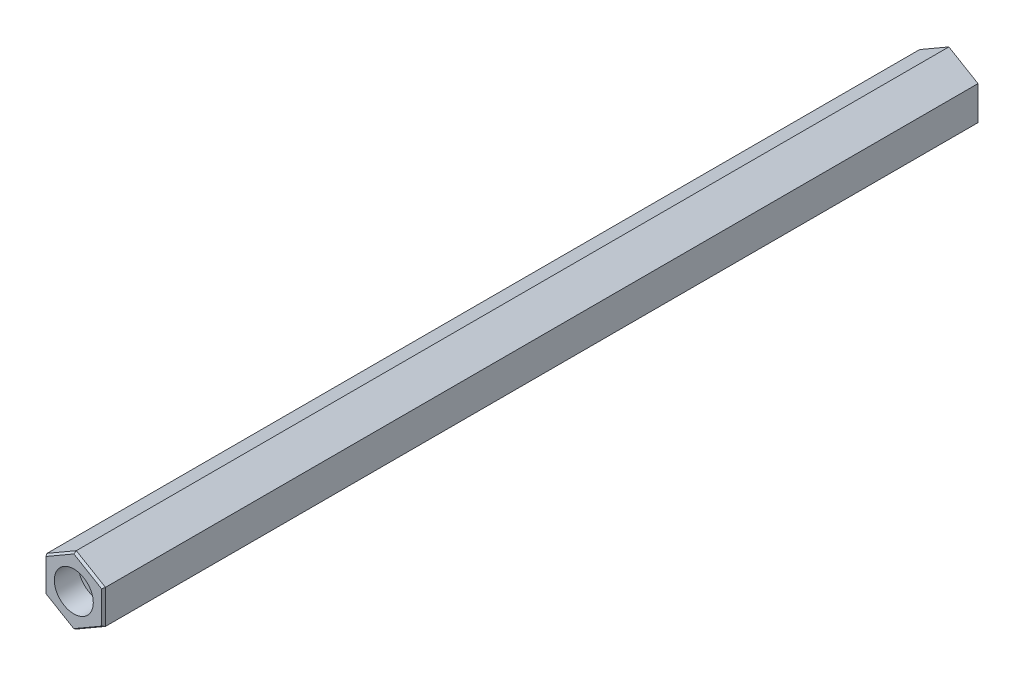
ISO-10303-21;
HEADER;
FILE_DESCRIPTION(('STEP AP214'),'2;1');
FILE_NAME('part.step','',(''),(''),'','','');
FILE_SCHEMA(('AUTOMOTIVE_DESIGN { 1 0 10303 214 1 1 1 1 }'));
ENDSEC;
DATA;
#1=APPLICATION_CONTEXT('core data for automotive mechanical design processes');
#2=APPLICATION_PROTOCOL_DEFINITION('international standard','automotive_design',2000,#1);
#3=PRODUCT_CONTEXT('',#1,'mechanical');
#4=PRODUCT('Part','Part','',(#3));
#5=PRODUCT_RELATED_PRODUCT_CATEGORY('part','',(#4));
#6=PRODUCT_DEFINITION_FORMATION('','',#4);
#7=PRODUCT_DEFINITION_CONTEXT('part definition',#1,'design');
#8=PRODUCT_DEFINITION('design','',#6,#7);
#9=PRODUCT_DEFINITION_SHAPE('','',#8);
#10=(LENGTH_UNIT() NAMED_UNIT(*) SI_UNIT(.MILLI.,.METRE.));
#11=(NAMED_UNIT(*) PLANE_ANGLE_UNIT() SI_UNIT($,.RADIAN.));
#12=(NAMED_UNIT(*) SI_UNIT($,.STERADIAN.) SOLID_ANGLE_UNIT());
#13=UNCERTAINTY_MEASURE_WITH_UNIT(LENGTH_MEASURE(1.E-05),#10,'distance_accuracy_value','');
#14=(GEOMETRIC_REPRESENTATION_CONTEXT(3) GLOBAL_UNCERTAINTY_ASSIGNED_CONTEXT((#13)) GLOBAL_UNIT_ASSIGNED_CONTEXT((#10,
#11,#12)) REPRESENTATION_CONTEXT('',''));
#15=CARTESIAN_POINT('',(0.,0.,0.));
#16=DIRECTION('',(0.,0.,1.));
#17=DIRECTION('',(1.,0.,0.));
#18=AXIS2_PLACEMENT_3D('',#15,#16,#17);
#19=CARTESIAN_POINT('',(-12.0000000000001,7.0471016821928,-180.));
#20=DIRECTION('',(-1.,0.,0.));
#21=DIRECTION('',(0.,-1.,0.));
#22=AXIS2_PLACEMENT_3D('',#19,#20,#21);
#23=PLANE('',#22);
#24=DIRECTION('',(0.,0.,1.));
#25=VECTOR('',#24,1.);
#26=CARTESIAN_POINT('',(-12.0000000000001,7.0471016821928,-180.));
#27=LINE('',#26,#25);
#28=CARTESIAN_POINT('',(-12.0000000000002,7.04710168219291,-179.422649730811));
#29=VERTEX_POINT('',#28);
#30=CARTESIAN_POINT('',(-12.,7.04710168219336,179.));
#31=VERTEX_POINT('',#30);
#32=EDGE_CURVE('E118',#29,#31,#27,.T.);
#33=ORIENTED_EDGE('',*,*,#32,.F.);
#34=DIRECTION('',(0.,-1.,0.));
#35=VECTOR('',#34,1.);
#36=CARTESIAN_POINT('',(-12.0000000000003,-6.85289831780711,-179.422649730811));
#37=LINE('',#36,#35);
#38=CARTESIAN_POINT('',(-12.0000000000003,-6.85289831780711,-179.422649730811));
#39=VERTEX_POINT('',#38);
#40=EDGE_CURVE('E113',#29,#39,#37,.T.);
#41=ORIENTED_EDGE('',*,*,#40,.T.);
#42=DIRECTION('',(0.,0.,1.));
#43=VECTOR('',#42,1.);
#44=CARTESIAN_POINT('',(-12.,-6.85289831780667,-180.));
#45=LINE('',#44,#43);
#46=CARTESIAN_POINT('',(-12.0000000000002,-6.85289831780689,179.));
#47=VERTEX_POINT('',#46);
#48=EDGE_CURVE('E115',#39,#47,#45,.T.);
#49=ORIENTED_EDGE('',*,*,#48,.T.);
#50=DIRECTION('',(0.,1.,0.));
#51=VECTOR('',#50,1.);
#52=CARTESIAN_POINT('',(-12.0000000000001,7.04710168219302,179.));
#53=LINE('',#52,#51);
#54=EDGE_CURVE('E124',#47,#31,#53,.T.);
#55=ORIENTED_EDGE('',*,*,#54,.T.);
#56=EDGE_LOOP('',(#33,#41,#49,#55));
#57=FACE_BOUND('',#56,.T.);
#58=ADVANCED_FACE('F26',(#57),#23,.T.);
#59=CARTESIAN_POINT('',(-12.0000000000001,7.0471016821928,-180.));
#60=DIRECTION('',(-0.501166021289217,0.865351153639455,0.));
#61=DIRECTION('',(-0.865351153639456,-0.501166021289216,0.));
#62=AXIS2_PLACEMENT_3D('',#59,#60,#61);
#63=PLANE('',#62);
#64=DIRECTION('',(0.,0.,1.));
#65=VECTOR('',#64,1.);
#66=CARTESIAN_POINT('',(0.0283810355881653,14.0133093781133,-180.));
#67=LINE('',#66,#65);
#68=CARTESIAN_POINT('',(0.0283810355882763,14.013309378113,-179.42264973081));
#69=VERTEX_POINT('',#68);
#70=CARTESIAN_POINT('',(0.0283810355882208,14.0133093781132,179.));
#71=VERTEX_POINT('',#70);
#72=EDGE_CURVE('E241',#69,#71,#67,.T.);
#73=ORIENTED_EDGE('',*,*,#72,.F.);
#74=DIRECTION('',(-0.865351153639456,-0.501166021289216,0.));
#75=VECTOR('',#74,1.);
#76=CARTESIAN_POINT('',(-12.0000000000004,7.04710168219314,-179.422649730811));
#77=LINE('',#76,#75);
#78=EDGE_CURVE('E180',#69,#29,#77,.T.);
#79=ORIENTED_EDGE('',*,*,#78,.T.);
#80=ORIENTED_EDGE('',*,*,#32,.T.);
#81=DIRECTION('',(0.865351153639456,0.501166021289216,0.));
#82=VECTOR('',#81,1.);
#83=CARTESIAN_POINT('',(-12.,7.04710168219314,179.));
#84=LINE('',#83,#82);
#85=EDGE_CURVE('E177',#31,#71,#84,.T.);
#86=ORIENTED_EDGE('',*,*,#85,.T.);
#87=EDGE_LOOP('',(#73,#79,#80,#86));
#88=FACE_BOUND('',#87,.T.);
#89=ADVANCED_FACE('F278',(#88),#63,.T.);
#90=CARTESIAN_POINT('',(0.0283810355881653,14.0133093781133,-180.));
#91=DIRECTION('',(0.508151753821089,0.861267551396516,0.));
#92=DIRECTION('',(-0.861267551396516,0.508151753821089,0.));
#93=AXIS2_PLACEMENT_3D('',#90,#91,#92);
#94=PLANE('',#93);
#95=DIRECTION('',(0.,0.,1.));
#96=VECTOR('',#95,1.);
#97=CARTESIAN_POINT('',(11.9999999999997,6.95000000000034,-180.));
#98=LINE('',#97,#96);
#99=CARTESIAN_POINT('',(11.9999999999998,6.95000000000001,-179.42264973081));
#100=VERTEX_POINT('',#99);
#101=CARTESIAN_POINT('',(12.,6.95000000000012,179.));
#102=VERTEX_POINT('',#101);
#103=EDGE_CURVE('E244',#100,#102,#98,.T.);
#104=ORIENTED_EDGE('',*,*,#103,.F.);
#105=DIRECTION('',(-0.861267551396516,0.508151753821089,0.));
#106=VECTOR('',#105,1.);
#107=CARTESIAN_POINT('',(0.0283810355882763,14.013309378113,-179.42264973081));
#108=LINE('',#107,#106);
#109=EDGE_CURVE('E175',#100,#69,#108,.T.);
#110=ORIENTED_EDGE('',*,*,#109,.T.);
#111=ORIENTED_EDGE('',*,*,#72,.T.);
#112=DIRECTION('',(0.861267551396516,-0.508151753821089,0.));
#113=VECTOR('',#112,1.);
#114=CARTESIAN_POINT('',(0.0283810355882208,14.0133093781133,179.));
#115=LINE('',#114,#113);
#116=EDGE_CURVE('E173',#71,#102,#115,.T.);
#117=ORIENTED_EDGE('',*,*,#116,.T.);
#118=EDGE_LOOP('',(#104,#110,#111,#117));
#119=FACE_BOUND('',#118,.T.);
#120=ADVANCED_FACE('F276',(#119),#94,.T.);
#121=CARTESIAN_POINT('',(11.9999999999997,6.95000000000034,-180.));
#122=DIRECTION('',(1.,0.,0.));
#123=DIRECTION('',(0.,0.,-1.));
#124=AXIS2_PLACEMENT_3D('',#121,#122,#123);
#125=PLANE('',#124);
#126=DIRECTION('',(0.,0.,1.));
#127=VECTOR('',#126,1.);
#128=CARTESIAN_POINT('',(11.9999999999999,-6.95000000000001,-180.));
#129=LINE('',#128,#127);
#130=CARTESIAN_POINT('',(11.9999999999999,-6.95000000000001,-179.42264973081));
#131=VERTEX_POINT('',#130);
#132=CARTESIAN_POINT('',(11.9999999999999,-6.94999999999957,179.));
#133=VERTEX_POINT('',#132);
#134=EDGE_CURVE('E247',#131,#133,#129,.T.);
#135=ORIENTED_EDGE('',*,*,#134,.F.);
#136=DIRECTION('',(0.,1.,0.));
#137=VECTOR('',#136,1.);
#138=CARTESIAN_POINT('',(11.9999999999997,6.95000000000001,-179.422649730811));
#139=LINE('',#138,#137);
#140=EDGE_CURVE('E171',#131,#100,#139,.T.);
#141=ORIENTED_EDGE('',*,*,#140,.T.);
#142=ORIENTED_EDGE('',*,*,#103,.T.);
#143=DIRECTION('',(0.,-1.,0.));
#144=VECTOR('',#143,1.);
#145=CARTESIAN_POINT('',(11.9999999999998,6.95000000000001,179.));
#146=LINE('',#145,#144);
#147=EDGE_CURVE('E169',#102,#133,#146,.T.);
#148=ORIENTED_EDGE('',*,*,#147,.T.);
#149=EDGE_LOOP('',(#135,#141,#142,#148));
#150=FACE_BOUND('',#149,.T.);
#151=ADVANCED_FACE('F255',(#150),#125,.T.);
#152=CARTESIAN_POINT('',(11.9999999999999,-6.95000000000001,-180.));
#153=DIRECTION('',(0.501166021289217,-0.865351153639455,0.));
#154=DIRECTION('',(0.865351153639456,0.501166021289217,0.));
#155=AXIS2_PLACEMENT_3D('',#152,#153,#154);
#156=PLANE('',#155);
#157=DIRECTION('',(0.,0.,1.));
#158=VECTOR('',#157,1.);
#159=CARTESIAN_POINT('',(-0.0283810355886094,-13.9162076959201,-180.));
#160=LINE('',#159,#158);
#161=CARTESIAN_POINT('',(-0.0283810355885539,-13.9162076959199,-179.422649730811));
#162=VERTEX_POINT('',#161);
#163=CARTESIAN_POINT('',(-0.0283810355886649,-13.9162076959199,179.));
#164=VERTEX_POINT('',#163);
#165=EDGE_CURVE('E135',#162,#164,#160,.T.);
#166=ORIENTED_EDGE('',*,*,#165,.F.);
#167=DIRECTION('',(0.865351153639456,0.501166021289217,0.));
#168=VECTOR('',#167,1.);
#169=CARTESIAN_POINT('',(11.9999999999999,-6.95000000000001,-179.42264973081));
#170=LINE('',#169,#168);
#171=EDGE_CURVE('E167',#162,#131,#170,.T.);
#172=ORIENTED_EDGE('',*,*,#171,.T.);
#173=ORIENTED_EDGE('',*,*,#134,.T.);
#174=DIRECTION('',(-0.865351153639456,-0.501166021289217,0.));
#175=VECTOR('',#174,1.);
#176=CARTESIAN_POINT('',(11.9999999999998,-6.9499999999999,179.));
#177=LINE('',#176,#175);
#178=EDGE_CURVE('E165',#133,#164,#177,.T.);
#179=ORIENTED_EDGE('',*,*,#178,.T.);
#180=EDGE_LOOP('',(#166,#172,#173,#179));
#181=FACE_BOUND('',#180,.T.);
#182=ADVANCED_FACE('F251',(#181),#156,.T.);
#183=CARTESIAN_POINT('',(-12.,-6.85289831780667,-180.));
#184=DIRECTION('',(-0.508151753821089,-0.861267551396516,0.));
#185=DIRECTION('',(0.861267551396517,-0.508151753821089,0.));
#186=AXIS2_PLACEMENT_3D('',#183,#184,#185);
#187=PLANE('',#186);
#188=ORIENTED_EDGE('',*,*,#48,.F.);
#189=DIRECTION('',(0.861267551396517,-0.508151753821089,0.));
#190=VECTOR('',#189,1.);
#191=CARTESIAN_POINT('',(-0.0283810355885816,-13.9162076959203,-179.422649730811));
#192=LINE('',#191,#190);
#193=EDGE_CURVE('E131',#39,#162,#192,.T.);
#194=ORIENTED_EDGE('',*,*,#193,.T.);
#195=ORIENTED_EDGE('',*,*,#165,.T.);
#196=DIRECTION('',(-0.861267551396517,0.508151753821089,0.));
#197=VECTOR('',#196,1.);
#198=CARTESIAN_POINT('',(-12.0000000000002,-6.85289831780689,179.));
#199=LINE('',#198,#197);
#200=EDGE_CURVE('E134',#164,#47,#199,.T.);
#201=ORIENTED_EDGE('',*,*,#200,.T.);
#202=EDGE_LOOP('',(#188,#194,#195,#201));
#203=FACE_BOUND('',#202,.T.);
#204=ADVANCED_FACE('F128',(#203),#187,.T.);
#205=CARTESIAN_POINT('',(-12.0000000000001,7.0471016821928,-180.));
#206=DIRECTION('',(0.,0.,1.));
#207=DIRECTION('',(1.,0.,0.));
#208=AXIS2_PLACEMENT_3D('',#205,#206,#207);
#209=PLANE('',#208);
#210=CARTESIAN_POINT('',(-3.60822483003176E-13,-2.22044604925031E-13,-180.));
#211=DIRECTION('',(0.,0.,-1.));
#212=DIRECTION('',(-1.,0.,0.));
#213=AXIS2_PLACEMENT_3D('',#210,#211,#212);
#214=CIRCLE('',#213,8.);
#215=CARTESIAN_POINT('',(-8.00000000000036,-2.22488694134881E-13,-180.));
#216=VERTEX_POINT('',#215);
#217=EDGE_CURVE('E281',#216,#216,#214,.T.);
#218=ORIENTED_EDGE('',*,*,#217,.F.);
#219=EDGE_LOOP('',(#218));
#220=FACE_BOUND('',#219,.T.);
#221=DIRECTION('',(-0.865351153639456,-0.501166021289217,0.));
#222=VECTOR('',#221,1.);
#223=CARTESIAN_POINT('',(-0.529547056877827,-13.0508565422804,-180.));
#224=LINE('',#223,#222);
#225=CARTESIAN_POINT('',(10.9999999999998,-6.37354733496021,-180.));
#226=VERTEX_POINT('',#225);
#227=CARTESIAN_POINT('',(-0.0236946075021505,-12.7578933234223,-180.));
#228=VERTEX_POINT('',#227);
#229=EDGE_CURVE('E161',#226,#228,#224,.T.);
#230=ORIENTED_EDGE('',*,*,#229,.T.);
#231=DIRECTION('',(-0.861267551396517,0.508151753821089,0.));
#232=VECTOR('',#231,1.);
#233=CARTESIAN_POINT('',(-11.491848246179,-5.99163076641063,-180.));
#234=LINE('',#233,#232);
#235=CARTESIAN_POINT('',(-11.0000000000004,-6.28182345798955,-180.));
#236=VERTEX_POINT('',#235);
#237=EDGE_CURVE('E163',#228,#236,#234,.T.);
#238=ORIENTED_EDGE('',*,*,#237,.T.);
#239=DIRECTION('',(0.,1.,0.));
#240=VECTOR('',#239,1.);
#241=CARTESIAN_POINT('',(-11.,7.04710168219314,-180.));
#242=LINE('',#241,#240);
#243=CARTESIAN_POINT('',(-11.0000000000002,6.47064901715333,-180.));
#244=VERTEX_POINT('',#243);
#245=EDGE_CURVE('E141',#236,#244,#242,.T.);
#246=ORIENTED_EDGE('',*,*,#245,.T.);
#247=DIRECTION('',(0.865351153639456,0.501166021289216,0.));
#248=VECTOR('',#247,1.);
#249=CARTESIAN_POINT('',(0.529547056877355,13.1479582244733,-180.));
#250=LINE('',#249,#248);
#251=CARTESIAN_POINT('',(0.0236946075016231,12.8549950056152,-180.));
#252=VERTEX_POINT('',#251);
#253=EDGE_CURVE('E152',#244,#252,#250,.T.);
#254=ORIENTED_EDGE('',*,*,#253,.T.);
#255=DIRECTION('',(0.861267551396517,-0.508151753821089,0.));
#256=VECTOR('',#255,1.);
#257=CARTESIAN_POINT('',(11.4918482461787,6.08873244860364,-180.));
#258=LINE('',#257,#256);
#259=CARTESIAN_POINT('',(10.9999999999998,6.37892514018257,-180.));
#260=VERTEX_POINT('',#259);
#261=EDGE_CURVE('E157',#252,#260,#258,.T.);
#262=ORIENTED_EDGE('',*,*,#261,.T.);
#263=DIRECTION('',(0.,-1.,0.));
#264=VECTOR('',#263,1.);
#265=CARTESIAN_POINT('',(10.9999999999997,-6.95000000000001,-180.));
#266=LINE('',#265,#264);
#267=EDGE_CURVE('E159',#260,#226,#266,.T.);
#268=ORIENTED_EDGE('',*,*,#267,.T.);
#269=EDGE_LOOP('',(#230,#238,#246,#254,#262,#268));
#270=FACE_BOUND('',#269,.T.);
#271=ADVANCED_FACE('F266',(#220,#270),#209,.F.);
#272=CARTESIAN_POINT('',(-12.,7.04710168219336,180.));
#273=DIRECTION('',(0.,0.,1.));
#274=DIRECTION('',(1.,0.,0.));
#275=AXIS2_PLACEMENT_3D('',#272,#273,#274);
#276=PLANE('',#275);
#277=CARTESIAN_POINT('',(-3.05311331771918E-13,0.,180.));
#278=DIRECTION('',(0.,0.,1.));
#279=DIRECTION('',(1.,0.,0.));
#280=AXIS2_PLACEMENT_3D('',#277,#278,#279);
#281=CIRCLE('',#280,8.);
#282=CARTESIAN_POINT('',(7.9999999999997,0.,180.));
#283=VERTEX_POINT('',#282);
#284=EDGE_CURVE('E289',#283,#283,#281,.T.);
#285=ORIENTED_EDGE('',*,*,#284,.F.);
#286=EDGE_LOOP('',(#285));
#287=FACE_BOUND('',#286,.T.);
#288=DIRECTION('',(-0.861267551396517,0.508151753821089,0.));
#289=VECTOR('',#288,1.);
#290=CARTESIAN_POINT('',(-6.13864163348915,16.9815311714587,180.));
#291=LINE('',#290,#289);
#292=CARTESIAN_POINT('',(11.4226497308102,6.6202897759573,180.));
#293=VERTEX_POINT('',#292);
#294=CARTESIAN_POINT('',(0.0256753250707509,13.3445562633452,180.));
#295=VERTEX_POINT('',#294);
#296=EDGE_CURVE('E33',#293,#295,#291,.T.);
#297=ORIENTED_EDGE('',*,*,#296,.T.);
#298=DIRECTION('',(-0.865351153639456,-0.501166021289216,0.));
#299=VECTOR('',#298,1.);
#300=CARTESIAN_POINT('',(-11.7106516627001,6.54749096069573,180.));
#301=LINE('',#300,#299);
#302=CARTESIAN_POINT('',(-11.4226497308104,6.71428658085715,180.));
#303=VERTEX_POINT('',#302);
#304=EDGE_CURVE('E11',#295,#303,#301,.T.);
#305=ORIENTED_EDGE('',*,*,#304,.T.);
#306=DIRECTION('',(0.,-1.,0.));
#307=VECTOR('',#306,1.);
#308=CARTESIAN_POINT('',(-11.4226497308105,7.04710168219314,180.));
#309=LINE('',#308,#307);
#310=CARTESIAN_POINT('',(-11.4226497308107,-6.52318809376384,180.));
#311=VERTEX_POINT('',#310);
#312=EDGE_CURVE('E123',#303,#311,#309,.T.);
#313=ORIENTED_EDGE('',*,*,#312,.T.);
#314=DIRECTION('',(0.861267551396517,-0.508151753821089,0.));
#315=VECTOR('',#314,1.);
#316=CARTESIAN_POINT('',(-17.7900176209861,-2.76641221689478,180.));
#317=LINE('',#316,#315);
#318=CARTESIAN_POINT('',(-0.0256753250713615,-13.2474545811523,180.));
#319=VERTEX_POINT('',#318);
#320=EDGE_CURVE('E184',#311,#319,#317,.T.);
#321=ORIENTED_EDGE('',*,*,#320,.T.);
#322=DIRECTION('',(0.865351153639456,0.501166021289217,0.));
#323=VECTOR('',#322,1.);
#324=CARTESIAN_POINT('',(-0.191003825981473,-13.3432041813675,180.));
#325=LINE('',#324,#323);
#326=CARTESIAN_POINT('',(11.4226497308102,-6.61718489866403,180.));
#327=VERTEX_POINT('',#326);
#328=EDGE_CURVE('E186',#319,#327,#325,.T.);
#329=ORIENTED_EDGE('',*,*,#328,.T.);
#330=DIRECTION('',(0.,1.,0.));
#331=VECTOR('',#330,1.);
#332=CARTESIAN_POINT('',(11.4226497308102,7.04710168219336,180.));
#333=LINE('',#332,#331);
#334=EDGE_CURVE('E43',#327,#293,#333,.T.);
#335=ORIENTED_EDGE('',*,*,#334,.T.);
#336=EDGE_LOOP('',(#297,#305,#313,#321,#329,#335));
#337=FACE_BOUND('',#336,.T.);
#338=ADVANCED_FACE('F190',(#287,#337),#276,.T.);
#339=CARTESIAN_POINT('',(0.0283810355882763,14.013309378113,-179.42264973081));
#340=DIRECTION('',(0.254075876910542,0.430633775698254,-0.866025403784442));
#341=DIRECTION('',(0.,0.895408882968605,0.445244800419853));
#342=AXIS2_PLACEMENT_3D('',#339,#340,#341);
#343=PLANE('',#342);
#344=DIRECTION('',(-0.776276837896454,-0.443312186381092,-0.448183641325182));
#345=VECTOR('',#344,1.);
#346=CARTESIAN_POINT('',(7.21655154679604,4.21829284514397,-182.184374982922));
#347=LINE('',#346,#345);
#348=EDGE_CURVE('E235',#260,#100,#347,.F.);
#349=ORIENTED_EDGE('',*,*,#348,.F.);
#350=ORIENTED_EDGE('',*,*,#261,.F.);
#351=DIRECTION('',(-0.00362099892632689,-0.89497908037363,-0.44609341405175));
#352=VECTOR('',#351,1.);
#353=CARTESIAN_POINT('',(0.00564780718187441,8.39448311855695,-182.223297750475));
#354=LINE('',#353,#352);
#355=EDGE_CURVE('E136',#69,#252,#354,.T.);
#356=ORIENTED_EDGE('',*,*,#355,.F.);
#357=ORIENTED_EDGE('',*,*,#109,.F.);
#358=EDGE_LOOP('',(#349,#350,#356,#357));
#359=FACE_BOUND('',#358,.T.);
#360=ADVANCED_FACE('F272',(#359),#343,.T.);
#361=CARTESIAN_POINT('',(-12.0000000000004,7.04710168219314,-179.422649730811));
#362=DIRECTION('',(-0.250583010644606,0.432675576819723,-0.866025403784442));
#363=DIRECTION('',(0.,0.894566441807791,0.446934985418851));
#364=AXIS2_PLACEMENT_3D('',#361,#362,#363);
#365=PLANE('',#364);
#366=ORIENTED_EDGE('',*,*,#355,.T.);
#367=ORIENTED_EDGE('',*,*,#253,.F.);
#368=DIRECTION('',(0.774837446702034,-0.446657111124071,-0.447352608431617));
#369=VECTOR('',#368,1.);
#370=CARTESIAN_POINT('',(-12.0000000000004,7.04710168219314,-179.422649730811));
#371=LINE('',#370,#369);
#372=EDGE_CURVE('E233',#29,#244,#371,.T.);
#373=ORIENTED_EDGE('',*,*,#372,.F.);
#374=ORIENTED_EDGE('',*,*,#78,.F.);
#375=EDGE_LOOP('',(#366,#367,#373,#374));
#376=FACE_BOUND('',#375,.T.);
#377=ADVANCED_FACE('F301',(#376),#365,.T.);
#378=CARTESIAN_POINT('',(11.9999999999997,6.95000000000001,-179.422649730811));
#379=DIRECTION('',(0.499999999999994,0.,-0.866025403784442));
#380=DIRECTION('',(-0.866025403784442,0.,-0.499999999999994));
#381=AXIS2_PLACEMENT_3D('',#378,#379,#380);
#382=PLANE('',#381);
#383=ORIENTED_EDGE('',*,*,#348,.T.);
#384=ORIENTED_EDGE('',*,*,#140,.F.);
#385=DIRECTION('',(-0.774837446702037,0.446657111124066,-0.447352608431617));
#386=VECTOR('',#385,1.);
#387=CARTESIAN_POINT('',(7.1893954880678,-4.17691420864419,-182.200053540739));
#388=LINE('',#387,#386);
#389=EDGE_CURVE('E145',#226,#131,#388,.F.);
#390=ORIENTED_EDGE('',*,*,#389,.F.);
#391=ORIENTED_EDGE('',*,*,#267,.F.);
#392=EDGE_LOOP('',(#383,#384,#390,#391));
#393=FACE_BOUND('',#392,.T.);
#394=ADVANCED_FACE('F259',(#393),#382,.T.);
#395=CARTESIAN_POINT('',(-12.0000000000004,7.04710168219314,-179.422649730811));
#396=DIRECTION('',(-0.499999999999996,0.,-0.866025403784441));
#397=DIRECTION('',(-0.866025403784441,0.,0.499999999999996));
#398=AXIS2_PLACEMENT_3D('',#395,#396,#397);
#399=PLANE('',#398);
#400=ORIENTED_EDGE('',*,*,#372,.T.);
#401=ORIENTED_EDGE('',*,*,#245,.F.);
#402=DIRECTION('',(-0.776276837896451,-0.443312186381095,0.448183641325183));
#403=VECTOR('',#402,1.);
#404=CARTESIAN_POINT('',(-7.21655154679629,-4.1211911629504,-182.184374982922));
#405=LINE('',#404,#403);
#406=EDGE_CURVE('E139',#39,#236,#405,.F.);
#407=ORIENTED_EDGE('',*,*,#406,.F.);
#408=ORIENTED_EDGE('',*,*,#40,.F.);
#409=EDGE_LOOP('',(#400,#401,#407,#408));
#410=FACE_BOUND('',#409,.T.);
#411=ADVANCED_FACE('F140',(#410),#399,.T.);
#412=CARTESIAN_POINT('',(11.9999999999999,-6.95000000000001,-179.42264973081));
#413=DIRECTION('',(0.250583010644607,-0.432675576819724,-0.866025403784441));
#414=DIRECTION('',(0.,0.89456644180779,-0.446934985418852));
#415=AXIS2_PLACEMENT_3D('',#412,#413,#414);
#416=PLANE('',#415);
#417=ORIENTED_EDGE('',*,*,#389,.T.);
#418=ORIENTED_EDGE('',*,*,#171,.F.);
#419=DIRECTION('',(0.00362099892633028,0.89497908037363,-0.44609341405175));
#420=VECTOR('',#419,1.);
#421=CARTESIAN_POINT('',(-0.00564780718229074,-8.2973814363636,-182.223297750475));
#422=LINE('',#421,#420);
#423=EDGE_CURVE('E146',#228,#162,#422,.F.);
#424=ORIENTED_EDGE('',*,*,#423,.F.);
#425=ORIENTED_EDGE('',*,*,#229,.F.);
#426=EDGE_LOOP('',(#417,#418,#424,#425));
#427=FACE_BOUND('',#426,.T.);
#428=ADVANCED_FACE('F264',(#427),#416,.T.);
#429=CARTESIAN_POINT('',(-12.0000000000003,-6.85289831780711,-179.422649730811));
#430=DIRECTION('',(-0.254075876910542,-0.430633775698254,-0.866025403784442));
#431=DIRECTION('',(0.,0.895408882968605,-0.445244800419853));
#432=AXIS2_PLACEMENT_3D('',#429,#430,#431);
#433=PLANE('',#432);
#434=ORIENTED_EDGE('',*,*,#406,.T.);
#435=ORIENTED_EDGE('',*,*,#237,.F.);
#436=ORIENTED_EDGE('',*,*,#423,.T.);
#437=ORIENTED_EDGE('',*,*,#193,.F.);
#438=EDGE_LOOP('',(#434,#435,#436,#437));
#439=FACE_BOUND('',#438,.T.);
#440=ADVANCED_FACE('F148',(#439),#433,.T.);
#441=CARTESIAN_POINT('',(-0.191003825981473,-13.3432041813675,180.));
#442=DIRECTION('',(-0.434022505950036,0.74941608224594,-0.499999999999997));
#443=DIRECTION('',(0.,0.554999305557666,0.831850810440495));
#444=AXIS2_PLACEMENT_3D('',#441,#442,#443);
#445=PLANE('',#444);
#446=DIRECTION('',(0.0022491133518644,0.555898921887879,0.831246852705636));
#447=VECTOR('',#446,1.);
#448=CARTESIAN_POINT('',(-0.012660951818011,-10.0307754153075,184.809965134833));
#449=LINE('',#448,#447);
#450=EDGE_CURVE('E201',#164,#319,#449,.T.);
#451=ORIENTED_EDGE('',*,*,#450,.F.);
#452=ORIENTED_EDGE('',*,*,#178,.F.);
#453=DIRECTION('',(-0.480441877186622,0.276952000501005,0.832149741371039));
#454=VECTOR('',#453,1.);
#455=CARTESIAN_POINT('',(9.63689482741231,-5.58778172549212,183.093018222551));
#456=LINE('',#455,#454);
#457=EDGE_CURVE('E197',#327,#133,#456,.F.);
#458=ORIENTED_EDGE('',*,*,#457,.F.);
#459=ORIENTED_EDGE('',*,*,#328,.F.);
#460=EDGE_LOOP('',(#451,#452,#458,#459));
#461=FACE_BOUND('',#460,.T.);
#462=ADVANCED_FACE('F198',(#461),#445,.F.);
#463=CARTESIAN_POINT('',(11.4226497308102,7.04710168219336,180.));
#464=DIRECTION('',(-0.866025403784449,0.,-0.499999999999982));
#465=DIRECTION('',(-0.499999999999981,0.,0.86602540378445));
#466=AXIS2_PLACEMENT_3D('',#463,#464,#465);
#467=PLANE('',#466);
#468=ORIENTED_EDGE('',*,*,#457,.T.);
#469=ORIENTED_EDGE('',*,*,#147,.F.);
#470=DIRECTION('',(-0.480784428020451,-0.274563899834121,0.832743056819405));
#471=VECTOR('',#470,1.);
#472=CARTESIAN_POINT('',(11.478991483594,6.65246513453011,179.902413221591));
#473=LINE('',#472,#471);
#474=EDGE_CURVE('E205',#293,#102,#473,.F.);
#475=ORIENTED_EDGE('',*,*,#474,.F.);
#476=ORIENTED_EDGE('',*,*,#334,.F.);
#477=EDGE_LOOP('',(#468,#469,#475,#476));
#478=FACE_BOUND('',#477,.T.);
#479=ADVANCED_FACE('F203',(#478),#467,.F.);
#480=CARTESIAN_POINT('',(-17.7900176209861,-2.76641221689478,180.));
#481=DIRECTION('',(0.440072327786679,0.745879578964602,-0.500000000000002));
#482=DIRECTION('',(0.,0.556816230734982,0.830635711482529));
#483=AXIS2_PLACEMENT_3D('',#480,#481,#482);
#484=PLANE('',#483);
#485=ORIENTED_EDGE('',*,*,#450,.T.);
#486=ORIENTED_EDGE('',*,*,#320,.F.);
#487=DIRECTION('',(0.480784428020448,0.274563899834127,0.832743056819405));
#488=VECTOR('',#487,1.);
#489=CARTESIAN_POINT('',(-9.63128941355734,-5.5001872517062,183.102727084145));
#490=LINE('',#489,#488);
#491=EDGE_CURVE('E208',#47,#311,#490,.T.);
#492=ORIENTED_EDGE('',*,*,#491,.F.);
#493=ORIENTED_EDGE('',*,*,#200,.F.);
#494=EDGE_LOOP('',(#485,#486,#492,#493));
#495=FACE_BOUND('',#494,.T.);
#496=ADVANCED_FACE('F223',(#495),#484,.F.);
#497=CARTESIAN_POINT('',(-6.13864163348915,16.9815311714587,180.));
#498=DIRECTION('',(-0.44007232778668,-0.745879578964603,-0.499999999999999));
#499=DIRECTION('',(0.,0.556816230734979,-0.830635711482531));
#500=AXIS2_PLACEMENT_3D('',#497,#498,#499);
#501=PLANE('',#500);
#502=ORIENTED_EDGE('',*,*,#474,.T.);
#503=ORIENTED_EDGE('',*,*,#116,.F.);
#504=DIRECTION('',(-0.0022491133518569,-0.555898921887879,0.831246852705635));
#505=VECTOR('',#504,1.);
#506=CARTESIAN_POINT('',(0.0301913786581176,14.4607602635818,178.330917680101));
#507=LINE('',#506,#505);
#508=EDGE_CURVE('E211',#295,#71,#507,.F.);
#509=ORIENTED_EDGE('',*,*,#508,.F.);
#510=ORIENTED_EDGE('',*,*,#296,.F.);
#511=EDGE_LOOP('',(#502,#503,#509,#510));
#512=FACE_BOUND('',#511,.T.);
#513=ADVANCED_FACE('F210',(#512),#501,.F.);
#514=CARTESIAN_POINT('',(-11.4226497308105,7.04710168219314,180.));
#515=DIRECTION('',(0.866025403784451,0.,-0.499999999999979));
#516=DIRECTION('',(-0.499999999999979,0.,-0.866025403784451));
#517=AXIS2_PLACEMENT_3D('',#514,#515,#516);
#518=PLANE('',#517);
#519=ORIENTED_EDGE('',*,*,#491,.T.);
#520=ORIENTED_EDGE('',*,*,#312,.F.);
#521=DIRECTION('',(-0.480441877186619,0.276952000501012,-0.832149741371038));
#522=VECTOR('',#521,1.);
#523=CARTESIAN_POINT('',(-11.4669338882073,6.73981430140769,179.923297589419));
#524=LINE('',#523,#522);
#525=EDGE_CURVE('E215',#31,#303,#524,.F.);
#526=ORIENTED_EDGE('',*,*,#525,.F.);
#527=ORIENTED_EDGE('',*,*,#54,.F.);
#528=EDGE_LOOP('',(#519,#520,#526,#527));
#529=FACE_BOUND('',#528,.T.);
#530=ADVANCED_FACE('F225',(#529),#518,.F.);
#531=CARTESIAN_POINT('',(-11.7106516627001,6.54749096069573,180.));
#532=DIRECTION('',(0.434022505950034,-0.749416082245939,-0.500000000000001));
#533=DIRECTION('',(0.,0.55499930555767,-0.831850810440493));
#534=AXIS2_PLACEMENT_3D('',#531,#532,#533);
#535=PLANE('',#534);
#536=ORIENTED_EDGE('',*,*,#508,.T.);
#537=ORIENTED_EDGE('',*,*,#85,.F.);
#538=ORIENTED_EDGE('',*,*,#525,.T.);
#539=ORIENTED_EDGE('',*,*,#304,.F.);
#540=EDGE_LOOP('',(#536,#537,#538,#539));
#541=FACE_BOUND('',#540,.T.);
#542=ADVANCED_FACE('F217',(#541),#535,.F.);
#543=CARTESIAN_POINT('',(-2.22044604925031E-13,4.44089209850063E-13,-170.));
#544=DIRECTION('',(0.,0.,-1.));
#545=DIRECTION('',(-1.,0.,0.));
#546=AXIS2_PLACEMENT_3D('',#543,#544,#545);
#547=CYLINDRICAL_SURFACE('',#546,8.);
#548=CARTESIAN_POINT('',(-2.22044604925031E-13,4.44089209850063E-13,-170.));
#549=DIRECTION('',(0.,0.,-1.));
#550=DIRECTION('',(-1.,0.,0.));
#551=AXIS2_PLACEMENT_3D('',#548,#549,#550);
#552=CIRCLE('',#551,8.);
#553=CARTESIAN_POINT('',(-8.00000000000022,4.43645120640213E-13,-170.));
#554=VERTEX_POINT('',#553);
#555=EDGE_CURVE('E279',#554,#554,#552,.T.);
#556=ORIENTED_EDGE('',*,*,#555,.F.);
#557=EDGE_LOOP('',(#556));
#558=FACE_BOUND('',#557,.T.);
#559=ORIENTED_EDGE('',*,*,#217,.T.);
#560=EDGE_LOOP('',(#559));
#561=FACE_BOUND('',#560,.T.);
#562=ADVANCED_FACE('F401',(#558,#561),#547,.F.);
#563=CARTESIAN_POINT('',(-2.22044604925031E-13,4.44089209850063E-13,-170.));
#564=DIRECTION('',(0.,0.,-1.));
#565=DIRECTION('',(-1.,0.,0.));
#566=AXIS2_PLACEMENT_3D('',#563,#564,#565);
#567=PLANE('',#566);
#568=ORIENTED_EDGE('',*,*,#555,.T.);
#569=EDGE_LOOP('',(#568));
#570=FACE_BOUND('',#569,.T.);
#571=ADVANCED_FACE('F408',(#570),#567,.T.);
#572=CARTESIAN_POINT('',(-1.66533453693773E-13,2.22044604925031E-13,170.));
#573=DIRECTION('',(0.,0.,1.));
#574=DIRECTION('',(1.,0.,0.));
#575=AXIS2_PLACEMENT_3D('',#572,#573,#574);
#576=CYLINDRICAL_SURFACE('',#575,8.);
#577=CARTESIAN_POINT('',(-1.66533453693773E-13,2.22044604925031E-13,170.));
#578=DIRECTION('',(0.,0.,1.));
#579=DIRECTION('',(1.,0.,0.));
#580=AXIS2_PLACEMENT_3D('',#577,#578,#579);
#581=CIRCLE('',#580,8.);
#582=CARTESIAN_POINT('',(7.99999999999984,2.22488694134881E-13,170.));
#583=VERTEX_POINT('',#582);
#584=EDGE_CURVE('E286',#583,#583,#581,.T.);
#585=ORIENTED_EDGE('',*,*,#584,.F.);
#586=EDGE_LOOP('',(#585));
#587=FACE_BOUND('',#586,.T.);
#588=ORIENTED_EDGE('',*,*,#284,.T.);
#589=EDGE_LOOP('',(#588));
#590=FACE_BOUND('',#589,.T.);
#591=ADVANCED_FACE('F293',(#587,#590),#576,.F.);
#592=CARTESIAN_POINT('',(-1.66533453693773E-13,2.22044604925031E-13,170.));
#593=DIRECTION('',(0.,0.,1.));
#594=DIRECTION('',(1.,0.,0.));
#595=AXIS2_PLACEMENT_3D('',#592,#593,#594);
#596=PLANE('',#595);
#597=ORIENTED_EDGE('',*,*,#584,.T.);
#598=EDGE_LOOP('',(#597));
#599=FACE_BOUND('',#598,.T.);
#600=ADVANCED_FACE('F423',(#599),#596,.T.);
#601=CLOSED_SHELL('',(#58,#89,#120,#151,#182,#204,#271,#338,#360,#377,#394,#411,#428,#440,#462,
#479,#496,#513,#530,#542,#562,#571,#591,#600));
#602=MANIFOLD_SOLID_BREP('B2',#601);
#603=ADVANCED_BREP_SHAPE_REPRESENTATION('',(#18,#602),#14);
#604=SHAPE_DEFINITION_REPRESENTATION(#9,#603);
ENDSEC;
END-ISO-10303-21;
